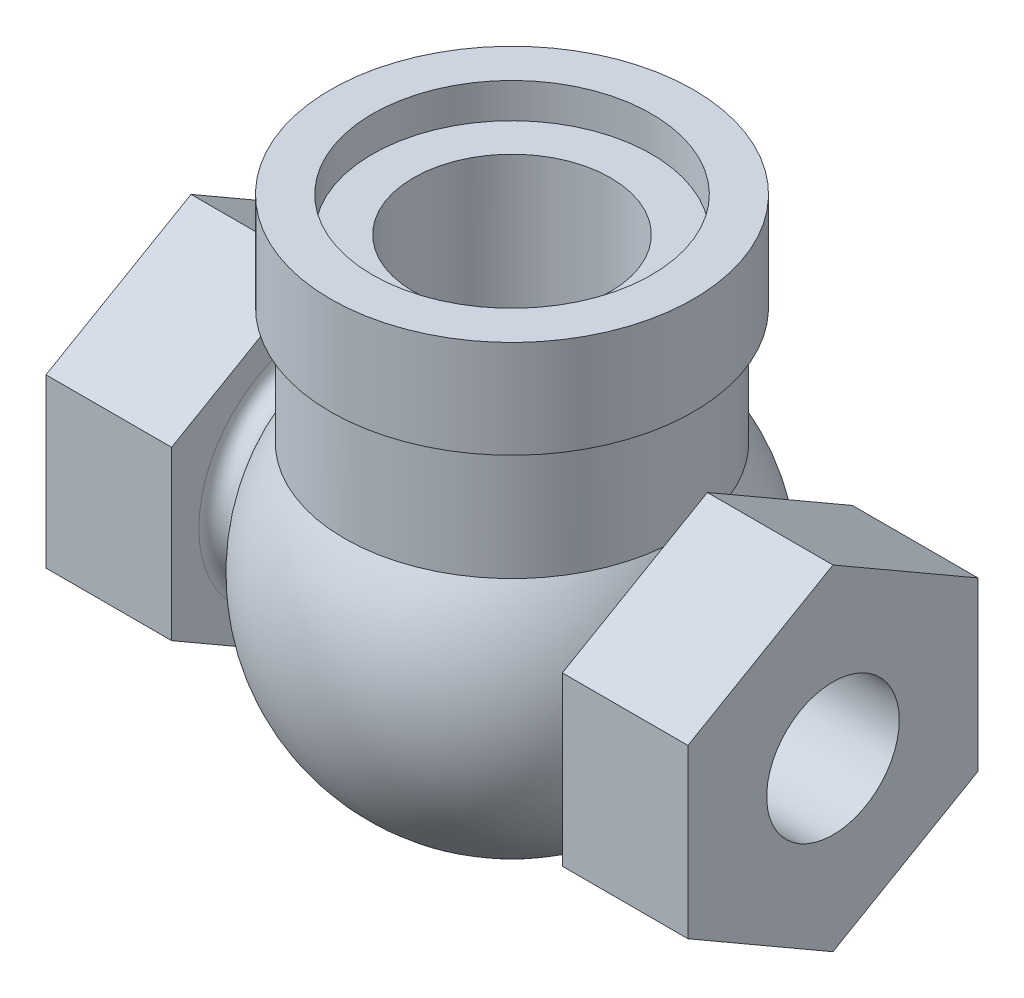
ISO-10303-21;
HEADER;
FILE_DESCRIPTION(('STEP AP214'),'2;1');
FILE_NAME('part.step','',(''),(''),'','','');
FILE_SCHEMA(('AUTOMOTIVE_DESIGN { 1 0 10303 214 1 1 1 1 }'));
ENDSEC;
DATA;
#1=APPLICATION_CONTEXT('core data for automotive mechanical design processes');
#2=APPLICATION_PROTOCOL_DEFINITION('international standard','automotive_design',2000,#1);
#3=PRODUCT_CONTEXT('',#1,'mechanical');
#4=PRODUCT('Part','Part','',(#3));
#5=PRODUCT_RELATED_PRODUCT_CATEGORY('part','',(#4));
#6=PRODUCT_DEFINITION_FORMATION('','',#4);
#7=PRODUCT_DEFINITION_CONTEXT('part definition',#1,'design');
#8=PRODUCT_DEFINITION('design','',#6,#7);
#9=PRODUCT_DEFINITION_SHAPE('','',#8);
#10=(LENGTH_UNIT() NAMED_UNIT(*) SI_UNIT(.MILLI.,.METRE.));
#11=(NAMED_UNIT(*) PLANE_ANGLE_UNIT() SI_UNIT($,.RADIAN.));
#12=(NAMED_UNIT(*) SI_UNIT($,.STERADIAN.) SOLID_ANGLE_UNIT());
#13=UNCERTAINTY_MEASURE_WITH_UNIT(LENGTH_MEASURE(1.E-05),#10,'distance_accuracy_value','');
#14=(GEOMETRIC_REPRESENTATION_CONTEXT(3) GLOBAL_UNCERTAINTY_ASSIGNED_CONTEXT((#13)) GLOBAL_UNIT_ASSIGNED_CONTEXT((#10,
#11,#12)) REPRESENTATION_CONTEXT('',''));
#15=CARTESIAN_POINT('',(0.,0.,0.));
#16=DIRECTION('',(0.,0.,1.));
#17=DIRECTION('',(1.,0.,0.));
#18=AXIS2_PLACEMENT_3D('',#15,#16,#17);
#19=CARTESIAN_POINT('',(20.9107335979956,-5.,0.));
#20=DIRECTION('',(-1.,0.,0.));
#21=DIRECTION('',(0.,0.,1.));
#22=AXIS2_PLACEMENT_3D('',#19,#20,#21);
#23=PLANE('',#22);
#24=CARTESIAN_POINT('',(20.9107335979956,-5.,0.));
#25=DIRECTION('',(1.,0.,0.));
#26=DIRECTION('',(0.,1.,0.));
#27=AXIS2_PLACEMENT_3D('',#24,#25,#26);
#28=CIRCLE('',#27,2.5);
#29=CARTESIAN_POINT('',(20.9107335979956,-2.5,0.));
#30=VERTEX_POINT('',#29);
#31=EDGE_CURVE('E645',#30,#30,#28,.F.);
#32=ORIENTED_EDGE('',*,*,#31,.T.);
#33=EDGE_LOOP('',(#32));
#34=FACE_BOUND('',#33,.T.);
#35=ADVANCED_FACE('F16',(#34),#23,.T.);
#36=CARTESIAN_POINT('',(-5.6,-5.00000000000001,0.));
#37=DIRECTION('',(1.,0.,0.));
#38=DIRECTION('',(0.,1.,0.));
#39=AXIS2_PLACEMENT_3D('',#36,#37,#38);
#40=CYLINDRICAL_SURFACE('',#39,2.5);
#41=ORIENTED_EDGE('',*,*,#31,.F.);
#42=EDGE_LOOP('',(#41));
#43=FACE_BOUND('',#42,.T.);
#44=CARTESIAN_POINT('',(0.,-5.00000000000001,0.));
#45=DIRECTION('',(0.707106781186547,-0.707106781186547,0.));
#46=DIRECTION('',(0.707106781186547,0.707106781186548,0.));
#47=AXIS2_PLACEMENT_3D('',#44,#45,#46);
#48=ELLIPSE('',#47,3.53553390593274,2.5);
#49=CARTESIAN_POINT('',(2.5,-2.50000000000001,0.));
#50=VERTEX_POINT('',#49);
#51=EDGE_CURVE('E323',#50,#50,#48,.F.);
#52=ORIENTED_EDGE('',*,*,#51,.T.);
#53=EDGE_LOOP('',(#52));
#54=FACE_BOUND('',#53,.T.);
#55=ADVANCED_FACE('F680',(#43,#54),#40,.F.);
#56=CARTESIAN_POINT('',(0.,-0.999999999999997,0.));
#57=DIRECTION('',(0.,-1.,0.));
#58=DIRECTION('',(1.,0.,0.));
#59=AXIS2_PLACEMENT_3D('',#56,#57,#58);
#60=CYLINDRICAL_SURFACE('',#59,2.5);
#61=ORIENTED_EDGE('',*,*,#51,.F.);
#62=EDGE_LOOP('',(#61));
#63=FACE_BOUND('',#62,.T.);
#64=CARTESIAN_POINT('',(0.,-1.0000000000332,0.));
#65=DIRECTION('',(0.,1.,0.));
#66=DIRECTION('',(0.,0.,1.));
#67=AXIS2_PLACEMENT_3D('',#64,#65,#66);
#68=CIRCLE('',#67,2.49999999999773);
#69=CARTESIAN_POINT('',(0.,-1.0000000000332,2.49999999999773));
#70=VERTEX_POINT('',#69);
#71=EDGE_CURVE('E321',#70,#70,#68,.T.);
#72=ORIENTED_EDGE('',*,*,#71,.T.);
#73=EDGE_LOOP('',(#72));
#74=FACE_BOUND('',#73,.T.);
#75=ADVANCED_FACE('F677',(#63,#74),#60,.F.);
#76=CARTESIAN_POINT('',(0.,2.99999999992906,0.));
#77=DIRECTION('',(0.,1.,0.));
#78=DIRECTION('',(0.,0.,1.));
#79=AXIS2_PLACEMENT_3D('',#76,#77,#78);
#80=CONICAL_SURFACE('',#79,6.49999999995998,0.785398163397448);
#81=ORIENTED_EDGE('',*,*,#71,.F.);
#82=EDGE_LOOP('',(#81));
#83=FACE_BOUND('',#82,.T.);
#84=CARTESIAN_POINT('',(0.,2.9999999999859,0.));
#85=DIRECTION('',(0.,1.,0.));
#86=DIRECTION('',(0.,0.,1.));
#87=AXIS2_PLACEMENT_3D('',#84,#85,#86);
#88=CIRCLE('',#87,6.50000000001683);
#89=CARTESIAN_POINT('',(0.,2.9999999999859,6.50000000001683));
#90=VERTEX_POINT('',#89);
#91=EDGE_CURVE('E320',#90,#90,#88,.F.);
#92=ORIENTED_EDGE('',*,*,#91,.F.);
#93=EDGE_LOOP('',(#92));
#94=FACE_BOUND('',#93,.T.);
#95=ADVANCED_FACE('F672',(#83,#94),#80,.F.);
#96=CARTESIAN_POINT('',(0.,3.,0.));
#97=DIRECTION('',(0.,1.,0.));
#98=DIRECTION('',(0.,0.,1.));
#99=AXIS2_PLACEMENT_3D('',#96,#97,#98);
#100=PLANE('',#99);
#101=DIRECTION('',(0.,0.,1.));
#102=VECTOR('',#101,1.);
#103=CARTESIAN_POINT('',(-12.,3.,0.));
#104=LINE('',#103,#102);
#105=CARTESIAN_POINT('',(-12.,3.,9.01387818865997));
#106=VERTEX_POINT('',#105);
#107=CARTESIAN_POINT('',(-12.,3.,-9.01387818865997));
#108=VERTEX_POINT('',#107);
#109=EDGE_CURVE('E60',#106,#108,#104,.F.);
#110=ORIENTED_EDGE('',*,*,#109,.F.);
#111=DIRECTION('',(1.,0.,0.));
#112=VECTOR('',#111,1.);
#113=CARTESIAN_POINT('',(0.,3.,9.01387818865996));
#114=LINE('',#113,#112);
#115=CARTESIAN_POINT('',(-10.875,3.,9.01387818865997));
#116=VERTEX_POINT('',#115);
#117=EDGE_CURVE('E61',#106,#116,#114,.T.);
#118=ORIENTED_EDGE('',*,*,#117,.T.);
#119=CARTESIAN_POINT('',(0.,3.,0.));
#120=DIRECTION('',(0.,1.,0.));
#121=DIRECTION('',(0.,0.,1.));
#122=AXIS2_PLACEMENT_3D('',#119,#120,#121);
#123=CIRCLE('',#122,14.125);
#124=CARTESIAN_POINT('',(-10.875,3.,-9.01387818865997));
#125=VERTEX_POINT('',#124);
#126=EDGE_CURVE('E55',#116,#125,#123,.T.);
#127=ORIENTED_EDGE('',*,*,#126,.T.);
#128=DIRECTION('',(1.,0.,0.));
#129=VECTOR('',#128,1.);
#130=CARTESIAN_POINT('',(0.,3.,-9.01387818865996));
#131=LINE('',#130,#129);
#132=EDGE_CURVE('E50',#125,#108,#131,.F.);
#133=ORIENTED_EDGE('',*,*,#132,.T.);
#134=EDGE_LOOP('',(#110,#118,#127,#133));
#135=FACE_BOUND('',#134,.T.);
#136=ORIENTED_EDGE('',*,*,#91,.T.);
#137=EDGE_LOOP('',(#136));
#138=FACE_BOUND('',#137,.T.);
#139=ADVANCED_FACE('F65',(#135,#138),#100,.T.);
#140=CARTESIAN_POINT('',(21.,0.,0.));
#141=DIRECTION('',(1.,0.,0.));
#142=DIRECTION('',(0.,0.,-1.));
#143=AXIS2_PLACEMENT_3D('',#140,#141,#142);
#144=PLANE('',#143);
#145=CARTESIAN_POINT('',(21.,0.,0.));
#146=DIRECTION('',(1.,0.,0.));
#147=DIRECTION('',(0.,0.,-1.));
#148=AXIS2_PLACEMENT_3D('',#145,#146,#147);
#149=CIRCLE('',#148,9.49999999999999);
#150=CARTESIAN_POINT('',(21.,0.,-9.49999999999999));
#151=VERTEX_POINT('',#150);
#152=EDGE_CURVE('E77',#151,#151,#149,.T.);
#153=ORIENTED_EDGE('',*,*,#152,.T.);
#154=EDGE_LOOP('',(#153));
#155=FACE_BOUND('',#154,.T.);
#156=ADVANCED_FACE('F112',(#155),#144,.T.);
#157=CARTESIAN_POINT('',(0.,42.,0.));
#158=DIRECTION('',(0.,1.,0.));
#159=DIRECTION('',(0.,0.,1.));
#160=AXIS2_PLACEMENT_3D('',#157,#158,#159);
#161=CYLINDRICAL_SURFACE('',#160,14.125);
#162=CARTESIAN_POINT('',(0.,42.,0.));
#163=DIRECTION('',(0.,1.,0.));
#164=DIRECTION('',(0.,0.,1.));
#165=AXIS2_PLACEMENT_3D('',#162,#163,#164);
#166=CIRCLE('',#165,14.125);
#167=CARTESIAN_POINT('',(0.,42.,14.125));
#168=VERTEX_POINT('',#167);
#169=EDGE_CURVE('E72',#168,#168,#166,.F.);
#170=ORIENTED_EDGE('',*,*,#169,.F.);
#171=EDGE_LOOP('',(#170));
#172=FACE_BOUND('',#171,.T.);
#173=ORIENTED_EDGE('',*,*,#126,.F.);
#174=CARTESIAN_POINT('',(-10.875,3.00000000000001,9.01387818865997));
#175=CARTESIAN_POINT('',(-10.9483719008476,3.26588564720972,8.92536657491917));
#176=CARTESIAN_POINT('',(-11.0290694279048,3.52582700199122,8.82580629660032));
#177=CARTESIAN_POINT('',(-11.2013979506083,4.03269002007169,8.60602723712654));
#178=CARTESIAN_POINT('',(-11.2930162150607,4.27962636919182,8.48583244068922));
#179=CARTESIAN_POINT('',(-11.4836510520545,4.75995723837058,8.22601749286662));
#180=CARTESIAN_POINT('',(-11.5826673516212,4.99335225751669,8.08639805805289));
#181=CARTESIAN_POINT('',(-11.7849566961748,5.44615700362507,7.78863411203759));
#182=CARTESIAN_POINT('',(-11.8882311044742,5.66556219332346,7.63048363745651));
#183=CARTESIAN_POINT('',(-12.095725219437,6.08891191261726,7.29708614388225));
#184=CARTESIAN_POINT('',(-12.1999397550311,6.29291272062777,7.12190730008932));
#185=CARTESIAN_POINT('',(-12.407095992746,6.68567380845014,6.754558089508));
#186=CARTESIAN_POINT('',(-12.5100377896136,6.87443522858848,6.5623889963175));
#187=CARTESIAN_POINT('',(-12.7121942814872,7.23579122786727,6.16166339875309));
#188=CARTESIAN_POINT('',(-12.8114098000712,7.40838939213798,5.95311054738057));
#189=CARTESIAN_POINT('',(-13.0037970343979,7.73632598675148,5.52023230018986));
#190=CARTESIAN_POINT('',(-13.0969694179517,7.89166632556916,5.2959086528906));
#191=CARTESIAN_POINT('',(-13.2633328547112,8.16458696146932,4.86273395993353));
#192=CARTESIAN_POINT('',(-13.3375421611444,8.28444778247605,4.65570923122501));
#193=CARTESIAN_POINT('',(-13.4782418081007,8.50911556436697,4.2311479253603));
#194=CARTESIAN_POINT('',(-13.544733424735,8.61392501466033,4.01361309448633));
#195=CARTESIAN_POINT('',(-13.668587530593,8.80739345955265,3.56910822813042));
#196=CARTESIAN_POINT('',(-13.7259553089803,8.89606181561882,3.34214375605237));
#197=CARTESIAN_POINT('',(-13.8303249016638,9.05626614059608,2.87990742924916));
#198=CARTESIAN_POINT('',(-13.8773266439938,9.12780199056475,2.64463551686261));
#199=CARTESIAN_POINT('',(-13.9600907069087,9.25314751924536,2.16584235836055));
#200=CARTESIAN_POINT('',(-13.9957808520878,9.30684346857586,1.92227870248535));
#201=CARTESIAN_POINT('',(-14.0545925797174,9.39505348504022,1.43019058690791));
#202=CARTESIAN_POINT('',(-14.0777140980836,9.42956745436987,1.18166610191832));
#203=CARTESIAN_POINT('',(-14.110754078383,9.47882322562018,0.681868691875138));
#204=CARTESIAN_POINT('',(-14.1206767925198,9.49357139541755,0.430596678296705));
#205=CARTESIAN_POINT('',(-14.1270532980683,9.50305344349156,-0.0724839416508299));
#206=CARTESIAN_POINT('',(-14.1235082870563,9.49778910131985,-0.324292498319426));
#207=CARTESIAN_POINT('',(-14.1041299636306,9.4689466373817,-0.799817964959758));
#208=CARTESIAN_POINT('',(-14.0896235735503,9.4473458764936,-1.02371292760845));
#209=CARTESIAN_POINT('',(-14.0502309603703,9.38849530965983,-1.46849228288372));
#210=CARTESIAN_POINT('',(-14.0253455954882,9.35124679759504,-1.68937692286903));
#211=CARTESIAN_POINT('',(-13.9657293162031,9.26159217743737,-2.12667146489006));
#212=CARTESIAN_POINT('',(-13.9309988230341,9.20918671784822,-2.34308155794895));
#213=CARTESIAN_POINT('',(-13.8524009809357,9.08985163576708,-2.77015570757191));
#214=CARTESIAN_POINT('',(-13.8085332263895,9.02292136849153,-2.98081950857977));
#215=CARTESIAN_POINT('',(-13.7115134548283,8.87373951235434,-3.39958409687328));
#216=CARTESIAN_POINT('',(-13.6581881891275,8.79119968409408,-3.60754177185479));
#217=CARTESIAN_POINT('',(-13.5438836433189,8.61254163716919,-4.01543586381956));
#218=CARTESIAN_POINT('',(-13.4829016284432,8.51641856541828,-4.21536938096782));
#219=CARTESIAN_POINT('',(-13.3543493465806,8.31140184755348,-4.60644790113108));
#220=CARTESIAN_POINT('',(-13.2867769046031,8.20250398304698,-4.7975899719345));
#221=CARTESIAN_POINT('',(-13.1461721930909,7.97273320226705,-5.17044403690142));
#222=CARTESIAN_POINT('',(-13.073139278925,7.85185887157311,-5.35215491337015));
#223=CARTESIAN_POINT('',(-12.9118927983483,7.58056189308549,-5.7312279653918));
#224=CARTESIAN_POINT('',(-12.8230105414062,7.42839337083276,-5.92705778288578));
#225=CARTESIAN_POINT('',(-12.6413566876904,7.11022755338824,-6.30521517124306));
#226=CARTESIAN_POINT('',(-12.5485847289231,6.94422896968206,-6.48754148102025));
#227=CARTESIAN_POINT('',(-12.3609695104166,6.59916028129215,-6.83824583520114));
#228=CARTESIAN_POINT('',(-12.2661260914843,6.42008916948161,-7.0066228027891));
#229=CARTESIAN_POINT('',(-12.0763167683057,6.04955494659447,-7.32892656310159));
#230=CARTESIAN_POINT('',(-11.981350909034,5.85809554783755,-7.48285765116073));
#231=CARTESIAN_POINT('',(-11.7927527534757,5.46204164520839,-7.77671298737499));
#232=CARTESIAN_POINT('',(-11.6991317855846,5.2573756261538,-7.91654824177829));
#233=CARTESIAN_POINT('',(-11.5161080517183,4.83642745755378,-8.18050550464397));
#234=CARTESIAN_POINT('',(-11.4267041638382,4.62014843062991,-8.30463170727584));
#235=CARTESIAN_POINT('',(-11.2545038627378,4.17614042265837,-8.53654706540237));
#236=CARTESIAN_POINT('',(-11.1717136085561,3.94840108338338,-8.64432107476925));
#237=CARTESIAN_POINT('',(-11.0155553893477,3.48210397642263,-8.84246234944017));
#238=CARTESIAN_POINT('',(-10.9421966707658,3.24353589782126,-8.93281257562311));
#239=CARTESIAN_POINT('',(-10.875,3.,-9.01387818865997));
#240=B_SPLINE_CURVE_WITH_KNOTS('',3,(#174,#175,#176,#177,#178,#179,#180,#181,#182,#183,#184,
#185,#186,#187,#188,#189,#190,#191,#192,#193,#194,#195,#196,#197,#198,#199,#200,#201,#202,#203,
#204,#205,#206,#207,#208,#209,#210,#211,#212,#213,#214,#215,#216,#217,#218,#219,#220,#221,#222,
#223,#224,#225,#226,#227,#228,#229,#230,#231,#232,#233,#234,#235,#236,#237,#238,#239),
.UNSPECIFIED.,.F.,.F.,(4,2,2,2,2,2,2,2,2,2,2,2,2,2,2,2,2,2,2,2,2,2,2,2,2,2,2,2,2,2,2,2,4),(0.,
0.868347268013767,1.73569195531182,2.60300465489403,3.47059723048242,4.33484913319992,
5.19903630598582,6.06303133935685,6.9269307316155,7.67758731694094,8.42811960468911,
9.17821520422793,9.92831601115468,10.6831108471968,11.4379095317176,12.1924649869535,
12.9469533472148,13.6223612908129,14.2977133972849,14.9730366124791,15.6483898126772,
16.3377102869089,17.0272776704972,17.7170734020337,18.4069506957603,19.1965115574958,
19.986146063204,20.7758414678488,21.5653013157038,22.359468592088,23.1534233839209,
23.9481091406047,24.7435681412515),.UNSPECIFIED.);
#241=EDGE_CURVE('E58',#116,#125,#240,.T.);
#242=ORIENTED_EDGE('',*,*,#241,.T.);
#243=EDGE_LOOP('',(#173,#242));
#244=FACE_BOUND('',#243,.T.);
#245=ADVANCED_FACE('F57',(#172,#244),#161,.F.);
#246=CARTESIAN_POINT('',(-12.,0.,0.));
#247=DIRECTION('',(-1.,0.,0.));
#248=DIRECTION('',(0.,0.,1.));
#249=AXIS2_PLACEMENT_3D('',#246,#247,#248);
#250=PLANE('',#249);
#251=CARTESIAN_POINT('',(-12.,0.,0.));
#252=DIRECTION('',(-1.,0.,0.));
#253=DIRECTION('',(0.,0.,1.));
#254=AXIS2_PLACEMENT_3D('',#251,#252,#253);
#255=CIRCLE('',#254,9.49999999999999);
#256=EDGE_CURVE('E71',#108,#106,#255,.T.);
#257=ORIENTED_EDGE('',*,*,#256,.T.);
#258=ORIENTED_EDGE('',*,*,#109,.T.);
#259=EDGE_LOOP('',(#257,#258));
#260=FACE_BOUND('',#259,.T.);
#261=ADVANCED_FACE('F102',(#260),#250,.T.);
#262=CARTESIAN_POINT('',(46.,0.,0.));
#263=DIRECTION('',(1.,0.,0.));
#264=DIRECTION('',(0.,0.,-1.));
#265=AXIS2_PLACEMENT_3D('',#262,#263,#264);
#266=CYLINDRICAL_SURFACE('',#265,9.49999999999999);
#267=ORIENTED_EDGE('',*,*,#152,.F.);
#268=EDGE_LOOP('',(#267));
#269=FACE_BOUND('',#268,.T.);
#270=CARTESIAN_POINT('',(46.,0.,0.));
#271=DIRECTION('',(1.,0.,0.));
#272=DIRECTION('',(0.,0.,-1.));
#273=AXIS2_PLACEMENT_3D('',#270,#271,#272);
#274=CIRCLE('',#273,9.49999999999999);
#275=CARTESIAN_POINT('',(46.,0.,-9.49999999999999));
#276=VERTEX_POINT('',#275);
#277=EDGE_CURVE('E74',#276,#276,#274,.T.);
#278=ORIENTED_EDGE('',*,*,#277,.T.);
#279=EDGE_LOOP('',(#278));
#280=FACE_BOUND('',#279,.T.);
#281=ADVANCED_FACE('F99',(#269,#280),#266,.F.);
#282=CARTESIAN_POINT('',(0.,42.,0.));
#283=DIRECTION('',(0.,1.,0.));
#284=DIRECTION('',(0.,0.,1.));
#285=AXIS2_PLACEMENT_3D('',#282,#283,#284);
#286=PLANE('',#285);
#287=CARTESIAN_POINT('',(0.,42.,0.));
#288=DIRECTION('',(0.,1.,0.));
#289=DIRECTION('',(0.,0.,1.));
#290=AXIS2_PLACEMENT_3D('',#287,#288,#289);
#291=CIRCLE('',#290,20.);
#292=CARTESIAN_POINT('',(0.,42.,20.));
#293=VERTEX_POINT('',#292);
#294=EDGE_CURVE('E340',#293,#293,#291,.T.);
#295=ORIENTED_EDGE('',*,*,#294,.T.);
#296=EDGE_LOOP('',(#295));
#297=FACE_BOUND('',#296,.T.);
#298=ORIENTED_EDGE('',*,*,#169,.T.);
#299=EDGE_LOOP('',(#298));
#300=FACE_BOUND('',#299,.T.);
#301=ADVANCED_FACE('F95',(#297,#300),#286,.T.);
#302=CARTESIAN_POINT('',(-46.,0.,0.));
#303=DIRECTION('',(-1.,0.,0.));
#304=DIRECTION('',(0.,0.,1.));
#305=AXIS2_PLACEMENT_3D('',#302,#303,#304);
#306=CYLINDRICAL_SURFACE('',#305,9.49999999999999);
#307=ORIENTED_EDGE('',*,*,#117,.F.);
#308=ORIENTED_EDGE('',*,*,#256,.F.);
#309=ORIENTED_EDGE('',*,*,#132,.F.);
#310=ORIENTED_EDGE('',*,*,#241,.F.);
#311=EDGE_LOOP('',(#307,#308,#309,#310));
#312=FACE_BOUND('',#311,.T.);
#313=CARTESIAN_POINT('',(-46.,0.,0.));
#314=DIRECTION('',(-1.,0.,0.));
#315=DIRECTION('',(0.,0.,1.));
#316=AXIS2_PLACEMENT_3D('',#313,#314,#315);
#317=CIRCLE('',#316,9.49999999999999);
#318=CARTESIAN_POINT('',(-46.,0.,9.49999999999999));
#319=VERTEX_POINT('',#318);
#320=EDGE_CURVE('E317',#319,#319,#317,.T.);
#321=ORIENTED_EDGE('',*,*,#320,.T.);
#322=EDGE_LOOP('',(#321));
#323=FACE_BOUND('',#322,.T.);
#324=ADVANCED_FACE('F69',(#312,#323),#306,.F.);
#325=CARTESIAN_POINT('',(46.,30.,0.));
#326=DIRECTION('',(-1.,0.,0.));
#327=DIRECTION('',(0.,0.,1.));
#328=AXIS2_PLACEMENT_3D('',#325,#326,#327);
#329=PLANE('',#328);
#330=DIRECTION('',(0.,0.499999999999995,-0.866025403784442));
#331=VECTOR('',#330,1.);
#332=CARTESIAN_POINT('',(46.,25.5,-2.5980762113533));
#333=LINE('',#332,#331);
#334=CARTESIAN_POINT('',(46.,24.,0.));
#335=VERTEX_POINT('',#334);
#336=CARTESIAN_POINT('',(46.,12.0000000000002,20.7846096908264));
#337=VERTEX_POINT('',#336);
#338=EDGE_CURVE('E290',#335,#337,#333,.F.);
#339=ORIENTED_EDGE('',*,*,#338,.T.);
#340=DIRECTION('',(0.,1.,0.));
#341=VECTOR('',#340,1.);
#342=CARTESIAN_POINT('',(46.,30.0000000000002,20.7846096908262));
#343=LINE('',#342,#341);
#344=CARTESIAN_POINT('',(46.,-11.9999999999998,20.7846096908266));
#345=VERTEX_POINT('',#344);
#346=EDGE_CURVE('E284',#337,#345,#343,.F.);
#347=ORIENTED_EDGE('',*,*,#346,.T.);
#348=DIRECTION('',(0.,0.500000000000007,0.866025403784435));
#349=VECTOR('',#348,1.);
#350=CARTESIAN_POINT('',(46.,-10.4999999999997,23.3826859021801));
#351=LINE('',#350,#349);
#352=CARTESIAN_POINT('',(46.,-24.,1.66996185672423E-13));
#353=VERTEX_POINT('',#352);
#354=EDGE_CURVE('E314',#345,#353,#351,.F.);
#355=ORIENTED_EDGE('',*,*,#354,.T.);
#356=DIRECTION('',(0.,-0.499999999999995,0.866025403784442));
#357=VECTOR('',#356,1.);
#358=CARTESIAN_POINT('',(46.,-10.5000000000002,-23.3826859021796));
#359=LINE('',#358,#357);
#360=CARTESIAN_POINT('',(46.,-12.0000000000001,-20.7846096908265));
#361=VERTEX_POINT('',#360);
#362=EDGE_CURVE('E308',#353,#361,#359,.F.);
#363=ORIENTED_EDGE('',*,*,#362,.T.);
#364=DIRECTION('',(0.,-1.,0.));
#365=VECTOR('',#364,1.);
#366=CARTESIAN_POINT('',(46.,29.9999999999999,-20.7846096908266));
#367=LINE('',#366,#365);
#368=CARTESIAN_POINT('',(46.,11.9999999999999,-20.7846096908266));
#369=VERTEX_POINT('',#368);
#370=EDGE_CURVE('E302',#361,#369,#367,.F.);
#371=ORIENTED_EDGE('',*,*,#370,.T.);
#372=DIRECTION('',(0.,-0.500000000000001,-0.866025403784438));
#373=VECTOR('',#372,1.);
#374=CARTESIAN_POINT('',(46.,25.5,2.59807621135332));
#375=LINE('',#374,#373);
#376=EDGE_CURVE('E296',#369,#335,#375,.F.);
#377=ORIENTED_EDGE('',*,*,#376,.T.);
#378=EDGE_LOOP('',(#339,#347,#355,#363,#371,#377));
#379=FACE_BOUND('',#378,.T.);
#380=ORIENTED_EDGE('',*,*,#277,.F.);
#381=EDGE_LOOP('',(#380));
#382=FACE_BOUND('',#381,.T.);
#383=ADVANCED_FACE('F94',(#379,#382),#329,.F.);
#384=CARTESIAN_POINT('',(0.,42.,0.));
#385=DIRECTION('',(0.,1.,0.));
#386=DIRECTION('',(0.,0.,1.));
#387=AXIS2_PLACEMENT_3D('',#384,#385,#386);
#388=CYLINDRICAL_SURFACE('',#387,20.);
#389=ORIENTED_EDGE('',*,*,#294,.F.);
#390=EDGE_LOOP('',(#389));
#391=FACE_BOUND('',#390,.T.);
#392=CARTESIAN_POINT('',(0.,47.,0.));
#393=DIRECTION('',(0.,1.,0.));
#394=DIRECTION('',(0.,0.,1.));
#395=AXIS2_PLACEMENT_3D('',#392,#393,#394);
#396=CIRCLE('',#395,20.);
#397=CARTESIAN_POINT('',(0.,47.,20.));
#398=VERTEX_POINT('',#397);
#399=EDGE_CURVE('E280',#398,#398,#396,.T.);
#400=ORIENTED_EDGE('',*,*,#399,.T.);
#401=EDGE_LOOP('',(#400));
#402=FACE_BOUND('',#401,.T.);
#403=ADVANCED_FACE('F347',(#391,#402),#388,.F.);
#404=CARTESIAN_POINT('',(-46.,30.,0.));
#405=DIRECTION('',(1.,0.,0.));
#406=DIRECTION('',(0.,0.,-1.));
#407=AXIS2_PLACEMENT_3D('',#404,#405,#406);
#408=PLANE('',#407);
#409=DIRECTION('',(0.,1.,0.));
#410=VECTOR('',#409,1.);
#411=CARTESIAN_POINT('',(-46.,12.,-20.7846096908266));
#412=LINE('',#411,#410);
#413=CARTESIAN_POINT('',(-46.,-12.0000000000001,-20.7846096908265));
#414=VERTEX_POINT('',#413);
#415=CARTESIAN_POINT('',(-46.,12.,-20.7846096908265));
#416=VERTEX_POINT('',#415);
#417=EDGE_CURVE('E277',#414,#416,#412,.T.);
#418=ORIENTED_EDGE('',*,*,#417,.F.);
#419=DIRECTION('',(0.,0.499999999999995,-0.866025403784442));
#420=VECTOR('',#419,1.);
#421=CARTESIAN_POINT('',(-46.,-12.0000000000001,-20.7846096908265));
#422=LINE('',#421,#420);
#423=CARTESIAN_POINT('',(-46.,-24.,1.66647129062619E-13));
#424=VERTEX_POINT('',#423);
#425=EDGE_CURVE('E274',#424,#414,#422,.T.);
#426=ORIENTED_EDGE('',*,*,#425,.F.);
#427=DIRECTION('',(0.,-0.500000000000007,-0.866025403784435));
#428=VECTOR('',#427,1.);
#429=CARTESIAN_POINT('',(-46.,-24.,1.6759110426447E-13));
#430=LINE('',#429,#428);
#431=CARTESIAN_POINT('',(-46.,-11.9999999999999,20.7846096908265));
#432=VERTEX_POINT('',#431);
#433=EDGE_CURVE('E268',#432,#424,#430,.T.);
#434=ORIENTED_EDGE('',*,*,#433,.F.);
#435=DIRECTION('',(0.,-1.,0.));
#436=VECTOR('',#435,1.);
#437=CARTESIAN_POINT('',(-46.,-11.9999999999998,20.7846096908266));
#438=LINE('',#437,#436);
#439=CARTESIAN_POINT('',(-46.,12.0000000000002,20.7846096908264));
#440=VERTEX_POINT('',#439);
#441=EDGE_CURVE('E262',#440,#432,#438,.T.);
#442=ORIENTED_EDGE('',*,*,#441,.F.);
#443=DIRECTION('',(0.,-0.499999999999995,0.866025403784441));
#444=VECTOR('',#443,1.);
#445=CARTESIAN_POINT('',(-46.,12.0000000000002,20.7846096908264));
#446=LINE('',#445,#444);
#447=CARTESIAN_POINT('',(-46.,24.,0.));
#448=VERTEX_POINT('',#447);
#449=EDGE_CURVE('E256',#448,#440,#446,.T.);
#450=ORIENTED_EDGE('',*,*,#449,.F.);
#451=DIRECTION('',(0.,0.500000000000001,0.866025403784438));
#452=VECTOR('',#451,1.);
#453=CARTESIAN_POINT('',(-46.,24.,0.));
#454=LINE('',#453,#452);
#455=EDGE_CURVE('E248',#416,#448,#454,.T.);
#456=ORIENTED_EDGE('',*,*,#455,.F.);
#457=EDGE_LOOP('',(#418,#426,#434,#442,#450,#456));
#458=FACE_BOUND('',#457,.T.);
#459=ORIENTED_EDGE('',*,*,#320,.F.);
#460=EDGE_LOOP('',(#459));
#461=FACE_BOUND('',#460,.T.);
#462=ADVANCED_FACE('F353',(#458,#461),#408,.F.);
#463=CARTESIAN_POINT('',(-59.4321261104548,-10.4999999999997,23.3826859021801));
#464=DIRECTION('',(0.,0.866025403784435,-0.500000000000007));
#465=DIRECTION('',(0.,0.500000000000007,0.866025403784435));
#466=AXIS2_PLACEMENT_3D('',#463,#464,#465);
#467=PLANE('',#466);
#468=DIRECTION('',(1.,0.,0.));
#469=VECTOR('',#468,1.);
#470=CARTESIAN_POINT('',(-59.4321261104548,-24.,1.6306400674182E-13));
#471=LINE('',#470,#469);
#472=CARTESIAN_POINT('',(28.,-24.,1.63468636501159E-13));
#473=VERTEX_POINT('',#472);
#474=EDGE_CURVE('E311',#473,#353,#471,.T.);
#475=ORIENTED_EDGE('',*,*,#474,.T.);
#476=ORIENTED_EDGE('',*,*,#354,.F.);
#477=DIRECTION('',(1.,0.,0.));
#478=VECTOR('',#477,1.);
#479=CARTESIAN_POINT('',(-59.4321261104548,-11.9999999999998,20.7846096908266));
#480=LINE('',#479,#478);
#481=CARTESIAN_POINT('',(28.,-11.9999999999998,20.7846096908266));
#482=VERTEX_POINT('',#481);
#483=EDGE_CURVE('E281',#345,#482,#480,.F.);
#484=ORIENTED_EDGE('',*,*,#483,.T.);
#485=DIRECTION('',(0.,-0.500000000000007,-0.866025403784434));
#486=VECTOR('',#485,1.);
#487=CARTESIAN_POINT('',(28.,-11.9999999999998,20.7846096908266));
#488=LINE('',#487,#486);
#489=EDGE_CURVE('E243',#482,#473,#488,.T.);
#490=ORIENTED_EDGE('',*,*,#489,.T.);
#491=EDGE_LOOP('',(#475,#476,#484,#490));
#492=FACE_BOUND('',#491,.T.);
#493=ADVANCED_FACE('F378',(#492),#467,.F.);
#494=CARTESIAN_POINT('',(-59.4321261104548,-10.5000000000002,-23.3826859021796));
#495=DIRECTION('',(0.,0.866025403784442,0.499999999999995));
#496=DIRECTION('',(0.,-0.499999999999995,0.866025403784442));
#497=AXIS2_PLACEMENT_3D('',#494,#495,#496);
#498=PLANE('',#497);
#499=DIRECTION('',(1.,0.,0.));
#500=VECTOR('',#499,1.);
#501=CARTESIAN_POINT('',(-59.4321261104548,-12.0000000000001,-20.7846096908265));
#502=LINE('',#501,#500);
#503=CARTESIAN_POINT('',(28.,-12.0000000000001,-20.7846096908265));
#504=VERTEX_POINT('',#503);
#505=EDGE_CURVE('E305',#504,#361,#502,.T.);
#506=ORIENTED_EDGE('',*,*,#505,.T.);
#507=ORIENTED_EDGE('',*,*,#362,.F.);
#508=ORIENTED_EDGE('',*,*,#474,.F.);
#509=DIRECTION('',(0.,0.499999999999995,-0.866025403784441));
#510=VECTOR('',#509,1.);
#511=CARTESIAN_POINT('',(28.,-24.,1.6306400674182E-13));
#512=LINE('',#511,#510);
#513=EDGE_CURVE('E240',#473,#504,#512,.T.);
#514=ORIENTED_EDGE('',*,*,#513,.T.);
#515=EDGE_LOOP('',(#506,#507,#508,#514));
#516=FACE_BOUND('',#515,.T.);
#517=ADVANCED_FACE('F411',(#516),#498,.F.);
#518=CARTESIAN_POINT('',(-59.4321261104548,29.9999999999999,-20.7846096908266));
#519=DIRECTION('',(0.,0.,1.));
#520=DIRECTION('',(0.,-1.,0.));
#521=AXIS2_PLACEMENT_3D('',#518,#519,#520);
#522=PLANE('',#521);
#523=DIRECTION('',(1.,0.,0.));
#524=VECTOR('',#523,1.);
#525=CARTESIAN_POINT('',(-59.4321261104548,11.9999999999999,-20.7846096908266));
#526=LINE('',#525,#524);
#527=CARTESIAN_POINT('',(28.,12.,-20.7846096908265));
#528=VERTEX_POINT('',#527);
#529=EDGE_CURVE('E299',#528,#369,#526,.T.);
#530=ORIENTED_EDGE('',*,*,#529,.T.);
#531=ORIENTED_EDGE('',*,*,#370,.F.);
#532=ORIENTED_EDGE('',*,*,#505,.F.);
#533=DIRECTION('',(0.,1.,0.));
#534=VECTOR('',#533,1.);
#535=CARTESIAN_POINT('',(28.,-24.,-20.7846096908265));
#536=LINE('',#535,#534);
#537=EDGE_CURVE('E237',#504,#528,#536,.T.);
#538=ORIENTED_EDGE('',*,*,#537,.T.);
#539=EDGE_LOOP('',(#530,#531,#532,#538));
#540=FACE_BOUND('',#539,.T.);
#541=ADVANCED_FACE('F416',(#540),#522,.F.);
#542=CARTESIAN_POINT('',(-59.4321261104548,25.5,2.59807621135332));
#543=DIRECTION('',(0.,-0.866025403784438,0.500000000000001));
#544=DIRECTION('',(0.,-0.500000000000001,-0.866025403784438));
#545=AXIS2_PLACEMENT_3D('',#542,#543,#544);
#546=PLANE('',#545);
#547=DIRECTION('',(1.,0.,0.));
#548=VECTOR('',#547,1.);
#549=CARTESIAN_POINT('',(-59.4321261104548,24.,0.));
#550=LINE('',#549,#548);
#551=CARTESIAN_POINT('',(28.,24.,0.));
#552=VERTEX_POINT('',#551);
#553=EDGE_CURVE('E293',#552,#335,#550,.T.);
#554=ORIENTED_EDGE('',*,*,#553,.T.);
#555=ORIENTED_EDGE('',*,*,#376,.F.);
#556=ORIENTED_EDGE('',*,*,#529,.F.);
#557=DIRECTION('',(0.,0.500000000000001,0.866025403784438));
#558=VECTOR('',#557,1.);
#559=CARTESIAN_POINT('',(28.,11.9999999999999,-20.7846096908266));
#560=LINE('',#559,#558);
#561=EDGE_CURVE('E234',#528,#552,#560,.T.);
#562=ORIENTED_EDGE('',*,*,#561,.T.);
#563=EDGE_LOOP('',(#554,#555,#556,#562));
#564=FACE_BOUND('',#563,.T.);
#565=ADVANCED_FACE('F421',(#564),#546,.F.);
#566=CARTESIAN_POINT('',(-59.4321261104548,25.5,-2.5980762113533));
#567=DIRECTION('',(0.,-0.866025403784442,-0.499999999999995));
#568=DIRECTION('',(0.,0.499999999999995,-0.866025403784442));
#569=AXIS2_PLACEMENT_3D('',#566,#567,#568);
#570=PLANE('',#569);
#571=DIRECTION('',(1.,0.,0.));
#572=VECTOR('',#571,1.);
#573=CARTESIAN_POINT('',(-59.4321261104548,12.0000000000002,20.7846096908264));
#574=LINE('',#573,#572);
#575=CARTESIAN_POINT('',(28.,12.0000000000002,20.7846096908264));
#576=VERTEX_POINT('',#575);
#577=EDGE_CURVE('E287',#576,#337,#574,.T.);
#578=ORIENTED_EDGE('',*,*,#577,.T.);
#579=ORIENTED_EDGE('',*,*,#338,.F.);
#580=ORIENTED_EDGE('',*,*,#553,.F.);
#581=DIRECTION('',(0.,-0.499999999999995,0.866025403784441));
#582=VECTOR('',#581,1.);
#583=CARTESIAN_POINT('',(28.,24.,0.));
#584=LINE('',#583,#582);
#585=EDGE_CURVE('E231',#552,#576,#584,.T.);
#586=ORIENTED_EDGE('',*,*,#585,.T.);
#587=EDGE_LOOP('',(#578,#579,#580,#586));
#588=FACE_BOUND('',#587,.T.);
#589=ADVANCED_FACE('F366',(#588),#570,.F.);
#590=CARTESIAN_POINT('',(-59.4321261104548,30.0000000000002,20.7846096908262));
#591=DIRECTION('',(0.,0.,-1.));
#592=DIRECTION('',(0.,1.,0.));
#593=AXIS2_PLACEMENT_3D('',#590,#591,#592);
#594=PLANE('',#593);
#595=ORIENTED_EDGE('',*,*,#483,.F.);
#596=ORIENTED_EDGE('',*,*,#346,.F.);
#597=ORIENTED_EDGE('',*,*,#577,.F.);
#598=DIRECTION('',(0.,1.,0.));
#599=VECTOR('',#598,1.);
#600=CARTESIAN_POINT('',(28.,-24.,20.7846096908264));
#601=LINE('',#600,#599);
#602=EDGE_CURVE('E223',#576,#482,#601,.F.);
#603=ORIENTED_EDGE('',*,*,#602,.T.);
#604=EDGE_LOOP('',(#595,#596,#597,#603));
#605=FACE_BOUND('',#604,.T.);
#606=ADVANCED_FACE('F372',(#605),#594,.F.);
#607=CARTESIAN_POINT('',(0.,47.,0.));
#608=DIRECTION('',(0.,-1.,0.));
#609=DIRECTION('',(0.,0.,-1.));
#610=AXIS2_PLACEMENT_3D('',#607,#608,#609);
#611=PLANE('',#610);
#612=CARTESIAN_POINT('',(0.,47.,0.));
#613=DIRECTION('',(0.,-1.,0.));
#614=DIRECTION('',(0.,0.,-1.));
#615=AXIS2_PLACEMENT_3D('',#612,#613,#614);
#616=CIRCLE('',#615,26.);
#617=CARTESIAN_POINT('',(0.,47.,-26.));
#618=VERTEX_POINT('',#617);
#619=EDGE_CURVE('E198',#618,#618,#616,.T.);
#620=ORIENTED_EDGE('',*,*,#619,.F.);
#621=EDGE_LOOP('',(#620));
#622=FACE_BOUND('',#621,.T.);
#623=ORIENTED_EDGE('',*,*,#399,.F.);
#624=EDGE_LOOP('',(#623));
#625=FACE_BOUND('',#624,.T.);
#626=ADVANCED_FACE('F474',(#622,#625),#611,.F.);
#627=CARTESIAN_POINT('',(59.4321261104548,12.,-20.7846096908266));
#628=DIRECTION('',(0.,0.,-1.));
#629=DIRECTION('',(0.,1.,0.));
#630=AXIS2_PLACEMENT_3D('',#627,#628,#629);
#631=PLANE('',#630);
#632=DIRECTION('',(1.,0.,0.));
#633=VECTOR('',#632,1.);
#634=CARTESIAN_POINT('',(59.4321261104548,12.,-20.7846096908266));
#635=LINE('',#634,#633);
#636=CARTESIAN_POINT('',(-28.,12.,-20.7846096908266));
#637=VERTEX_POINT('',#636);
#638=EDGE_CURVE('E251',#637,#416,#635,.F.);
#639=ORIENTED_EDGE('',*,*,#638,.F.);
#640=DIRECTION('',(0.,1.,0.));
#641=VECTOR('',#640,1.);
#642=CARTESIAN_POINT('',(-28.,-16.8819430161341,-20.7846096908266));
#643=LINE('',#642,#641);
#644=CARTESIAN_POINT('',(-28.,-12.0000000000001,-20.7846096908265));
#645=VERTEX_POINT('',#644);
#646=EDGE_CURVE('E196',#637,#645,#643,.F.);
#647=ORIENTED_EDGE('',*,*,#646,.T.);
#648=DIRECTION('',(1.,0.,0.));
#649=VECTOR('',#648,1.);
#650=CARTESIAN_POINT('',(59.4321261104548,-12.0000000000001,-20.7846096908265));
#651=LINE('',#650,#649);
#652=EDGE_CURVE('E271',#414,#645,#651,.T.);
#653=ORIENTED_EDGE('',*,*,#652,.F.);
#654=ORIENTED_EDGE('',*,*,#417,.T.);
#655=EDGE_LOOP('',(#639,#647,#653,#654));
#656=FACE_BOUND('',#655,.T.);
#657=ADVANCED_FACE('F452',(#656),#631,.T.);
#658=CARTESIAN_POINT('',(59.4321261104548,-12.0000000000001,-20.7846096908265));
#659=DIRECTION('',(0.,-0.866025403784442,-0.499999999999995));
#660=DIRECTION('',(0.,0.499999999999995,-0.866025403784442));
#661=AXIS2_PLACEMENT_3D('',#658,#659,#660);
#662=PLANE('',#661);
#663=ORIENTED_EDGE('',*,*,#652,.T.);
#664=DIRECTION('',(0.,-0.499999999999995,0.866025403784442));
#665=VECTOR('',#664,1.);
#666=CARTESIAN_POINT('',(-28.,-12.0000000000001,-20.7846096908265));
#667=LINE('',#666,#665);
#668=CARTESIAN_POINT('',(-28.,-24.,1.70267313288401E-13));
#669=VERTEX_POINT('',#668);
#670=EDGE_CURVE('E193',#645,#669,#667,.T.);
#671=ORIENTED_EDGE('',*,*,#670,.T.);
#672=DIRECTION('',(1.,0.,0.));
#673=VECTOR('',#672,1.);
#674=CARTESIAN_POINT('',(59.4321261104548,-24.,1.6759110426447E-13));
#675=LINE('',#674,#673);
#676=EDGE_CURVE('E265',#424,#669,#675,.T.);
#677=ORIENTED_EDGE('',*,*,#676,.F.);
#678=ORIENTED_EDGE('',*,*,#425,.T.);
#679=EDGE_LOOP('',(#663,#671,#677,#678));
#680=FACE_BOUND('',#679,.T.);
#681=ADVANCED_FACE('F454',(#680),#662,.T.);
#682=CARTESIAN_POINT('',(59.4321261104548,-24.,1.6759110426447E-13));
#683=DIRECTION('',(0.,-0.866025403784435,0.500000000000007));
#684=DIRECTION('',(0.,-0.500000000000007,-0.866025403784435));
#685=AXIS2_PLACEMENT_3D('',#682,#683,#684);
#686=PLANE('',#685);
#687=ORIENTED_EDGE('',*,*,#676,.T.);
#688=DIRECTION('',(0.,0.500000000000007,0.866025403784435));
#689=VECTOR('',#688,1.);
#690=CARTESIAN_POINT('',(-28.,-24.,1.70002900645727E-13));
#691=LINE('',#690,#689);
#692=CARTESIAN_POINT('',(-28.,-11.9999999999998,20.7846096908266));
#693=VERTEX_POINT('',#692);
#694=EDGE_CURVE('E190',#669,#693,#691,.T.);
#695=ORIENTED_EDGE('',*,*,#694,.T.);
#696=DIRECTION('',(1.,0.,0.));
#697=VECTOR('',#696,1.);
#698=CARTESIAN_POINT('',(59.4321261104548,-11.9999999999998,20.7846096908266));
#699=LINE('',#698,#697);
#700=EDGE_CURVE('E259',#432,#693,#699,.T.);
#701=ORIENTED_EDGE('',*,*,#700,.F.);
#702=ORIENTED_EDGE('',*,*,#433,.T.);
#703=EDGE_LOOP('',(#687,#695,#701,#702));
#704=FACE_BOUND('',#703,.T.);
#705=ADVANCED_FACE('F462',(#704),#686,.T.);
#706=CARTESIAN_POINT('',(59.4321261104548,-11.9999999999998,20.7846096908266));
#707=DIRECTION('',(0.,0.,1.));
#708=DIRECTION('',(0.,-1.,0.));
#709=AXIS2_PLACEMENT_3D('',#706,#707,#708);
#710=PLANE('',#709);
#711=ORIENTED_EDGE('',*,*,#700,.T.);
#712=DIRECTION('',(0.,1.,0.));
#713=VECTOR('',#712,1.);
#714=CARTESIAN_POINT('',(-28.,-16.8819430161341,20.7846096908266));
#715=LINE('',#714,#713);
#716=CARTESIAN_POINT('',(-28.,12.0000000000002,20.7846096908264));
#717=VERTEX_POINT('',#716);
#718=EDGE_CURVE('E181',#693,#717,#715,.T.);
#719=ORIENTED_EDGE('',*,*,#718,.T.);
#720=DIRECTION('',(1.,0.,0.));
#721=VECTOR('',#720,1.);
#722=CARTESIAN_POINT('',(59.4321261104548,12.0000000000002,20.7846096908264));
#723=LINE('',#722,#721);
#724=EDGE_CURVE('E253',#440,#717,#723,.T.);
#725=ORIENTED_EDGE('',*,*,#724,.F.);
#726=ORIENTED_EDGE('',*,*,#441,.T.);
#727=EDGE_LOOP('',(#711,#719,#725,#726));
#728=FACE_BOUND('',#727,.T.);
#729=ADVANCED_FACE('F460',(#728),#710,.T.);
#730=CARTESIAN_POINT('',(59.4321261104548,12.0000000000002,20.7846096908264));
#731=DIRECTION('',(0.,0.866025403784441,0.499999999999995));
#732=DIRECTION('',(0.,-0.499999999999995,0.866025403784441));
#733=AXIS2_PLACEMENT_3D('',#730,#731,#732);
#734=PLANE('',#733);
#735=ORIENTED_EDGE('',*,*,#724,.T.);
#736=DIRECTION('',(0.,0.499999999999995,-0.866025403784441));
#737=VECTOR('',#736,1.);
#738=CARTESIAN_POINT('',(-28.,12.0000000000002,20.7846096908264));
#739=LINE('',#738,#737);
#740=CARTESIAN_POINT('',(-28.,24.,0.));
#741=VERTEX_POINT('',#740);
#742=EDGE_CURVE('E172',#717,#741,#739,.T.);
#743=ORIENTED_EDGE('',*,*,#742,.T.);
#744=DIRECTION('',(1.,0.,0.));
#745=VECTOR('',#744,1.);
#746=CARTESIAN_POINT('',(59.4321261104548,24.,0.));
#747=LINE('',#746,#745);
#748=EDGE_CURVE('E246',#448,#741,#747,.T.);
#749=ORIENTED_EDGE('',*,*,#748,.F.);
#750=ORIENTED_EDGE('',*,*,#449,.T.);
#751=EDGE_LOOP('',(#735,#743,#749,#750));
#752=FACE_BOUND('',#751,.T.);
#753=ADVANCED_FACE('F441',(#752),#734,.T.);
#754=CARTESIAN_POINT('',(59.4321261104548,24.,0.));
#755=DIRECTION('',(0.,0.866025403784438,-0.500000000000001));
#756=DIRECTION('',(0.,0.500000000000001,0.866025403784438));
#757=AXIS2_PLACEMENT_3D('',#754,#755,#756);
#758=PLANE('',#757);
#759=ORIENTED_EDGE('',*,*,#748,.T.);
#760=DIRECTION('',(0.,-0.500000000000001,-0.866025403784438));
#761=VECTOR('',#760,1.);
#762=CARTESIAN_POINT('',(-28.,24.,0.));
#763=LINE('',#762,#761);
#764=EDGE_CURVE('E169',#741,#637,#763,.T.);
#765=ORIENTED_EDGE('',*,*,#764,.T.);
#766=ORIENTED_EDGE('',*,*,#638,.T.);
#767=ORIENTED_EDGE('',*,*,#455,.T.);
#768=EDGE_LOOP('',(#759,#765,#766,#767));
#769=FACE_BOUND('',#768,.T.);
#770=ADVANCED_FACE('F216',(#769),#758,.T.);
#771=CARTESIAN_POINT('',(28.,-24.,0.));
#772=DIRECTION('',(1.,0.,0.));
#773=DIRECTION('',(0.,0.,-1.));
#774=AXIS2_PLACEMENT_3D('',#771,#772,#773);
#775=PLANE('',#774);
#776=ORIENTED_EDGE('',*,*,#585,.F.);
#777=ORIENTED_EDGE('',*,*,#561,.F.);
#778=ORIENTED_EDGE('',*,*,#537,.F.);
#779=ORIENTED_EDGE('',*,*,#513,.F.);
#780=ORIENTED_EDGE('',*,*,#489,.F.);
#781=ORIENTED_EDGE('',*,*,#602,.F.);
#782=EDGE_LOOP('',(#776,#777,#778,#779,#780,#781));
#783=FACE_BOUND('',#782,.T.);
#784=CARTESIAN_POINT('',(28.,0.,0.));
#785=DIRECTION('',(-1.,0.,0.));
#786=DIRECTION('',(0.,0.,-1.));
#787=AXIS2_PLACEMENT_3D('',#784,#785,#786);
#788=CIRCLE('',#787,16.8819430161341);
#789=CARTESIAN_POINT('',(28.,0.,16.8819430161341));
#790=VERTEX_POINT('',#789);
#791=CARTESIAN_POINT('',(28.,0.,-16.8819430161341));
#792=VERTEX_POINT('',#791);
#793=EDGE_CURVE('E161',#790,#792,#788,.F.);
#794=ORIENTED_EDGE('',*,*,#793,.T.);
#795=CARTESIAN_POINT('',(28.,0.,0.));
#796=DIRECTION('',(-1.,0.,0.));
#797=DIRECTION('',(0.,0.,1.));
#798=AXIS2_PLACEMENT_3D('',#795,#796,#797);
#799=CIRCLE('',#798,16.8819430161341);
#800=EDGE_CURVE('E165',#792,#790,#799,.F.);
#801=ORIENTED_EDGE('',*,*,#800,.T.);
#802=EDGE_LOOP('',(#794,#801));
#803=FACE_BOUND('',#802,.T.);
#804=ADVANCED_FACE('F205',(#783,#803),#775,.F.);
#805=CARTESIAN_POINT('',(0.,0.,0.));
#806=DIRECTION('',(0.,-1.,0.));
#807=DIRECTION('',(0.,0.,-1.));
#808=AXIS2_PLACEMENT_3D('',#805,#806,#807);
#809=CYLINDRICAL_SURFACE('',#808,26.);
#810=CARTESIAN_POINT('',(0.,33.,0.));
#811=DIRECTION('',(0.,-1.,0.));
#812=DIRECTION('',(0.,0.,-1.));
#813=AXIS2_PLACEMENT_3D('',#810,#811,#812);
#814=CIRCLE('',#813,26.);
#815=CARTESIAN_POINT('',(0.,33.,-26.));
#816=VERTEX_POINT('',#815);
#817=EDGE_CURVE('E170',#816,#816,#814,.F.);
#818=ORIENTED_EDGE('',*,*,#817,.T.);
#819=EDGE_LOOP('',(#818));
#820=FACE_BOUND('',#819,.T.);
#821=ORIENTED_EDGE('',*,*,#619,.T.);
#822=EDGE_LOOP('',(#821));
#823=FACE_BOUND('',#822,.T.);
#824=ADVANCED_FACE('F215',(#820,#823),#809,.T.);
#825=CARTESIAN_POINT('',(-28.,-16.8819430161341,0.));
#826=DIRECTION('',(-1.,0.,0.));
#827=DIRECTION('',(0.,0.,1.));
#828=AXIS2_PLACEMENT_3D('',#825,#826,#827);
#829=PLANE('',#828);
#830=ORIENTED_EDGE('',*,*,#742,.F.);
#831=ORIENTED_EDGE('',*,*,#718,.F.);
#832=ORIENTED_EDGE('',*,*,#694,.F.);
#833=ORIENTED_EDGE('',*,*,#670,.F.);
#834=ORIENTED_EDGE('',*,*,#646,.F.);
#835=ORIENTED_EDGE('',*,*,#764,.F.);
#836=EDGE_LOOP('',(#830,#831,#832,#833,#834,#835));
#837=FACE_BOUND('',#836,.T.);
#838=CARTESIAN_POINT('',(-28.,0.,0.));
#839=DIRECTION('',(1.,0.,0.));
#840=DIRECTION('',(0.,0.,1.));
#841=AXIS2_PLACEMENT_3D('',#838,#839,#840);
#842=CIRCLE('',#841,16.8819430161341);
#843=CARTESIAN_POINT('',(-28.,0.,-16.8819430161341));
#844=VERTEX_POINT('',#843);
#845=CARTESIAN_POINT('',(-28.,0.,16.8819430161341));
#846=VERTEX_POINT('',#845);
#847=EDGE_CURVE('E330',#844,#846,#842,.F.);
#848=ORIENTED_EDGE('',*,*,#847,.T.);
#849=CARTESIAN_POINT('',(-28.,0.,0.));
#850=DIRECTION('',(1.,0.,0.));
#851=DIRECTION('',(0.,0.,-1.));
#852=AXIS2_PLACEMENT_3D('',#849,#850,#851);
#853=CIRCLE('',#852,16.8819430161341);
#854=EDGE_CURVE('E333',#846,#844,#853,.F.);
#855=ORIENTED_EDGE('',*,*,#854,.T.);
#856=EDGE_LOOP('',(#848,#855));
#857=FACE_BOUND('',#856,.T.);
#858=ADVANCED_FACE('F446',(#837,#857),#829,.F.);
#859=CARTESIAN_POINT('',(0.,33.,1.14491749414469E-13));
#860=DIRECTION('',(0.,1.,0.));
#861=DIRECTION('',(0.,0.,1.));
#862=AXIS2_PLACEMENT_3D('',#859,#860,#861);
#863=PLANE('',#862);
#864=ORIENTED_EDGE('',*,*,#817,.F.);
#865=EDGE_LOOP('',(#864));
#866=FACE_BOUND('',#865,.T.);
#867=CARTESIAN_POINT('',(0.,33.,0.));
#868=DIRECTION('',(0.,-1.,0.));
#869=DIRECTION('',(0.,0.,-1.));
#870=AXIS2_PLACEMENT_3D('',#867,#868,#869);
#871=CIRCLE('',#870,24.);
#872=CARTESIAN_POINT('',(0.,33.,-24.));
#873=VERTEX_POINT('',#872);
#874=EDGE_CURVE('E327',#873,#873,#871,.T.);
#875=ORIENTED_EDGE('',*,*,#874,.F.);
#876=EDGE_LOOP('',(#875));
#877=FACE_BOUND('',#876,.T.);
#878=ADVANCED_FACE('F143',(#866,#877),#863,.F.);
#879=CARTESIAN_POINT('',(26.,0.,0.));
#880=DIRECTION('',(-1.,0.,0.));
#881=DIRECTION('',(0.,0.,1.));
#882=AXIS2_PLACEMENT_3D('',#879,#880,#881);
#883=TOROIDAL_SURFACE('',#882,16.8819430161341,2.);
#884=ORIENTED_EDGE('',*,*,#800,.F.);
#885=ORIENTED_EDGE('',*,*,#793,.F.);
#886=EDGE_LOOP('',(#884,#885));
#887=FACE_BOUND('',#886,.T.);
#888=CARTESIAN_POINT('',(24.3225806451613,0.,0.));
#889=DIRECTION('',(-1.,0.,0.));
#890=DIRECTION('',(0.,0.,1.));
#891=AXIS2_PLACEMENT_3D('',#888,#889,#890);
#892=CIRCLE('',#891,15.79278540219);
#893=CARTESIAN_POINT('',(24.3225806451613,0.,15.79278540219));
#894=VERTEX_POINT('',#893);
#895=EDGE_CURVE('E135',#894,#894,#892,.T.);
#896=ORIENTED_EDGE('',*,*,#895,.F.);
#897=EDGE_LOOP('',(#896));
#898=FACE_BOUND('',#897,.T.);
#899=ADVANCED_FACE('F139',(#887,#898),#883,.F.);
#900=CARTESIAN_POINT('',(0.,0.,0.));
#901=DIRECTION('',(0.,-1.,0.));
#902=DIRECTION('',(0.,0.,-1.));
#903=AXIS2_PLACEMENT_3D('',#900,#901,#902);
#904=CYLINDRICAL_SURFACE('',#903,24.);
#905=ORIENTED_EDGE('',*,*,#874,.T.);
#906=EDGE_LOOP('',(#905));
#907=FACE_BOUND('',#906,.T.);
#908=CARTESIAN_POINT('',(0.,16.2788205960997,0.));
#909=DIRECTION('',(0.,-1.,0.));
#910=DIRECTION('',(1.,0.,0.));
#911=AXIS2_PLACEMENT_3D('',#908,#909,#910);
#912=CIRCLE('',#911,24.);
#913=CARTESIAN_POINT('',(24.,16.2788205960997,0.));
#914=VERTEX_POINT('',#913);
#915=EDGE_CURVE('E27',#914,#914,#912,.T.);
#916=ORIENTED_EDGE('',*,*,#915,.F.);
#917=EDGE_LOOP('',(#916));
#918=FACE_BOUND('',#917,.T.);
#919=ADVANCED_FACE('F122',(#907,#918),#904,.T.);
#920=CARTESIAN_POINT('',(-26.,0.,0.));
#921=DIRECTION('',(-1.,0.,0.));
#922=DIRECTION('',(0.,0.,1.));
#923=AXIS2_PLACEMENT_3D('',#920,#921,#922);
#924=TOROIDAL_SURFACE('',#923,16.8819430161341,2.);
#925=ORIENTED_EDGE('',*,*,#847,.F.);
#926=ORIENTED_EDGE('',*,*,#854,.F.);
#927=EDGE_LOOP('',(#925,#926));
#928=FACE_BOUND('',#927,.T.);
#929=CARTESIAN_POINT('',(-24.3225806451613,0.,0.));
#930=DIRECTION('',(-1.,0.,0.));
#931=DIRECTION('',(0.,0.,1.));
#932=AXIS2_PLACEMENT_3D('',#929,#930,#931);
#933=CIRCLE('',#932,15.79278540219);
#934=CARTESIAN_POINT('',(-24.3225806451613,0.,15.79278540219));
#935=VERTEX_POINT('',#934);
#936=EDGE_CURVE('E11',#935,#935,#933,.F.);
#937=ORIENTED_EDGE('',*,*,#936,.F.);
#938=EDGE_LOOP('',(#937));
#939=FACE_BOUND('',#938,.T.);
#940=ADVANCED_FACE('F116',(#928,#939),#924,.F.);
#941=CARTESIAN_POINT('',(0.,0.,0.));
#942=DIRECTION('',(0.,-1.,0.));
#943=DIRECTION('',(1.,0.,0.));
#944=AXIS2_PLACEMENT_3D('',#941,#942,#943);
#945=SPHERICAL_SURFACE('',#944,29.);
#946=ORIENTED_EDGE('',*,*,#915,.T.);
#947=EDGE_LOOP('',(#946));
#948=FACE_BOUND('',#947,.T.);
#949=ORIENTED_EDGE('',*,*,#936,.T.);
#950=EDGE_LOOP('',(#949));
#951=FACE_BOUND('',#950,.T.);
#952=CARTESIAN_POINT('',(0.,-29.,0.));
#953=VERTEX_POINT('',#952);
#954=VERTEX_LOOP('',#953);
#955=FACE_BOUND('',#954,.T.);
#956=ORIENTED_EDGE('',*,*,#895,.T.);
#957=EDGE_LOOP('',(#956));
#958=FACE_BOUND('',#957,.T.);
#959=ADVANCED_FACE('F114',(#948,#951,#955,#958),#945,.T.);
#960=CLOSED_SHELL('',(#35,#55,#75,#95,#139,#156,#245,#261,#281,#301,#324,#383,#403,#462,#493,
#517,#541,#565,#589,#606,#626,#657,#681,#705,#729,#753,#770,#804,#824,#858,#878,#899,#919,#940,#959));
#961=MANIFOLD_SOLID_BREP('B1',#960);
#962=ADVANCED_BREP_SHAPE_REPRESENTATION('',(#18,#961),#14);
#963=SHAPE_DEFINITION_REPRESENTATION(#9,#962);
ENDSEC;
END-ISO-10303-21;
